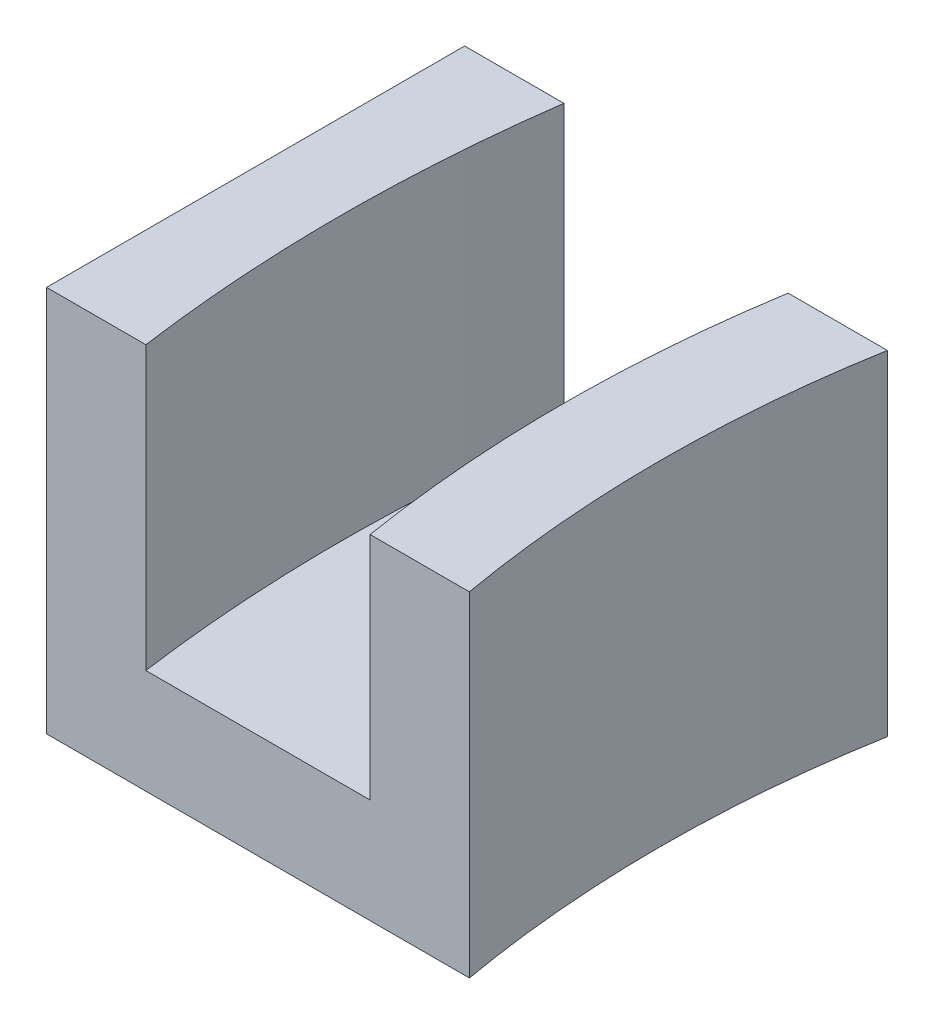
from build123d import *

# Parameters (mm, degrees)
BOSS_EXTRUDE1_DEPTH = 37
BOSS_EXTRUDE2_DEPTH = 32
BOSS_EXTRUDE3_DEPTH = 10
SKETCH3_R           = 1.4
CUT_EXTRUDE1_DEPTH  = 10


with BuildPart() as part:
    # Sketch2 → Boss-Extrude1 (new body)
    with BuildSketch(Plane(origin=(0, 0, 0), x_dir=(1, 0, 0), z_dir=(0, 1, 0))):
        with BuildLine():
            Line((-153.114066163, 105), (-153.114066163, 145))
            Line((-153.114066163, 145), (-143.614066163, 145))
            ThreePointArc((-143.614066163, 145), (-145, 125), (-143.614066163, 105))
            Line((-143.614066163, 105), (-153.114066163, 105))
        make_face()
    extrude(amount=BOSS_EXTRUDE1_DEPTH)



with BuildPart() as body_2:
    # Sketch2_4 → Boss-Extrude2 (new body)
    with BuildSketch(Plane(origin=(0, 0, 0), x_dir=(1, 0, 0), z_dir=(0, 1, 0))):
        with BuildLine():
            Line((-122.157321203, 105), (-112.657321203, 105))
            ThreePointArc((-112.657321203, 105), (-114.409804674, 125), (-112.657321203, 145))
            Line((-112.657321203, 145), (-122.157321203, 145))
            ThreePointArc((-122.157321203, 145), (-123.767694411, 125), (-122.157321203, 105))
        make_face()
    extrude(amount=BOSS_EXTRUDE2_DEPTH)


with BuildPart() as part_1:
    add(part.part)

    add(body_2.part)  # Boss-Extrude3 merges body 2
    # Sketch2_5 → Boss-Extrude3 (add)
    with BuildSketch(Plane(origin=(0, 0, 0), x_dir=(1, 0, 0), z_dir=(0, 1, 0))):
        with BuildLine():
            Line((-143.614066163, 145), (-122.157321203, 145))
            ThreePointArc((-122.157321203, 145), (-123.767694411, 125), (-122.157321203, 105))
            Line((-122.157321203, 105), (-143.614066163, 105))
            ThreePointArc((-143.614066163, 105), (-145, 125), (-143.614066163, 145))
        make_face()
    extrude(amount=BOSS_EXTRUDE3_DEPTH)

    # Sketch3 → Cut-Extrude1 (cut)
    with BuildSketch(Plane(origin=(0, 0, 0), x_dir=(-1, 0, 0), z_dir=(0, -1, 0))):
        with Locations(Location((133.114066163, 125, 0), (0, 0, 90))):
            Circle(SKETCH3_R)
    extrude(amount=-CUT_EXTRUDE1_DEPTH, mode=Mode.SUBTRACT)


solid = part_1.part
